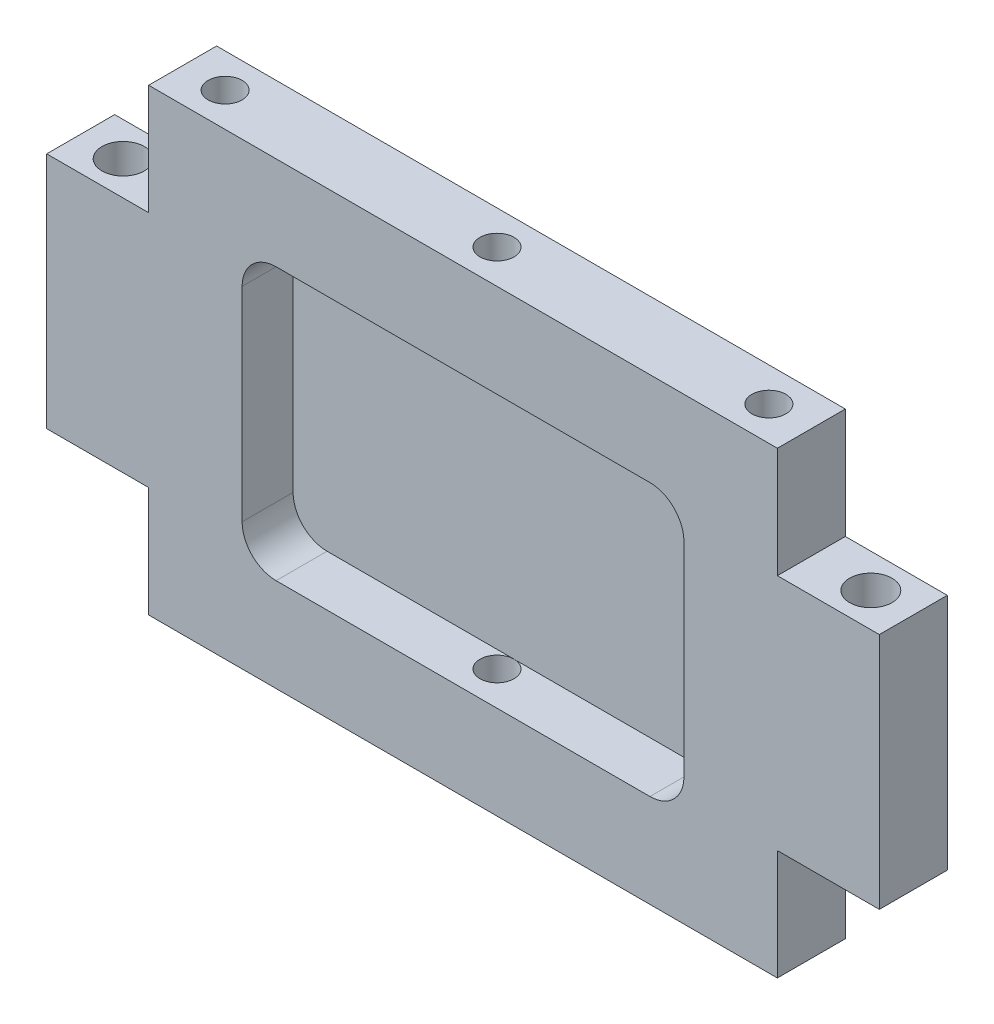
from build123d import *

# Parameters (mm, degrees)
BOSS_EXTRUDE1_DEPTH             = 6.35
SKETCH4_R                       = 3.9624
CUT_EXTRUDE1_DEPTH              = 38.1
F_1_4_0_25_DIAMETER_HOLE1_D     = 6.35
F_1_4_0_25_DIAMETER_HOLE1_DEPTH = 19.05
F_1_4_0_25_DIAMETER_HOLE1_TIP   = 1.907732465
F_1_4_0_25_DIAMETER_HOLE2_D     = 6.35
F_1_4_0_25_DIAMETER_HOLE2_DEPTH = 19.05
F_1_4_0_25_DIAMETER_HOLE2_TIP   = 1.907732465
CUT_EXTRUDE3_DEPTH              = 25.4
CUT_EXTRUDE3_DEPTH_BACK         = 3.175
SKETCH10_W                      = 82.55
SKETCH10_H                      = 50.8
FILLET1_R                       = 6.35


with BuildPart() as part:
    # Sketch2 → Boss-Extrude1 (new, symmetric)
    with BuildSketch(Plane.XY):
        Polygon((-58.7375, -42.8625), (58.7375, -42.8625), (58.7375, -22.2377), (77.7875, -22.2377), (77.7875, 22.2377), (58.7375, 22.2377), (58.7375, 42.8625), (-58.7375, 42.8625), (-58.7375, 22.2377), (-77.7875, 22.2377), (-77.7875, -22.2377), (-58.7375, -22.2377), align=None)
    extrude(amount=BOSS_EXTRUDE1_DEPTH, both=True)

    # Sketch4 → Cut-Extrude1 (cut, symmetric)
    with BuildSketch(Plane(origin=(0, 0, 0), x_dir=(1, 0, 0), z_dir=(0, 1, 0))):
        with Locations(Location((-69.85, 0, 0), (0, 0, 270))):
            Circle(SKETCH4_R)
        with Locations(Location((69.85, 0, 0), (0, 0, 270))):
            Circle(SKETCH4_R)
    extrude(amount=CUT_EXTRUDE1_DEPTH, both=True, mode=Mode.SUBTRACT)

    # 1_4 _0.25_ Diameter Hole1
    with Locations(Plane(origin=(0, -42.8625, 0), x_dir=(-1, 0, 0), z_dir=(0, -1, 0))):
        with Locations((50.8, 0), (0, 0), (-50.8, 0)):
            Hole(F_1_4_0_25_DIAMETER_HOLE1_D / 2, depth=F_1_4_0_25_DIAMETER_HOLE1_DEPTH)
            with Locations((0, 0, -(F_1_4_0_25_DIAMETER_HOLE1_DEPTH + F_1_4_0_25_DIAMETER_HOLE1_TIP / 2))):  # 118° drill point
                Cone(0, F_1_4_0_25_DIAMETER_HOLE1_D / 2, F_1_4_0_25_DIAMETER_HOLE1_TIP, mode=Mode.SUBTRACT)

    # 1_4 _0.25_ Diameter Hole2
    with Locations(Plane(origin=(0, 42.8625, 0), x_dir=(1, 0, 0), z_dir=(0, 1, 0))):
        with Locations((-50.8, 0), (0, 0), (50.8, 0)):
            Hole(F_1_4_0_25_DIAMETER_HOLE2_D / 2, depth=F_1_4_0_25_DIAMETER_HOLE2_DEPTH)
            with Locations((0, 0, -(F_1_4_0_25_DIAMETER_HOLE2_DEPTH + F_1_4_0_25_DIAMETER_HOLE2_TIP / 2))):  # 118° drill point
                Cone(0, F_1_4_0_25_DIAMETER_HOLE2_D / 2, F_1_4_0_25_DIAMETER_HOLE2_TIP, mode=Mode.SUBTRACT)

    # Sketch10 → Cut-Extrude3 (cut, two sides: drawn at the far end of the back side and taken through both)
    with BuildSketch(Plane.XY.offset(-CUT_EXTRUDE3_DEPTH_BACK)):
        Rectangle(SKETCH10_W, SKETCH10_H)
    extrude(amount=CUT_EXTRUDE3_DEPTH + CUT_EXTRUDE3_DEPTH_BACK, mode=Mode.SUBTRACT)

    # Fillet1
    fillet1_edges = [part.edges().sort_by_distance(p)[0] for p in [
        (-41.275, -25.4, 1.5875),
        (41.275, 25.4, 1.5875),
        (-41.275, 25.4, 1.5875),
        (41.275, -25.4, 1.5875),
    ]]
    fillet(fillet1_edges, radius=FILLET1_R)


solid = part.part
